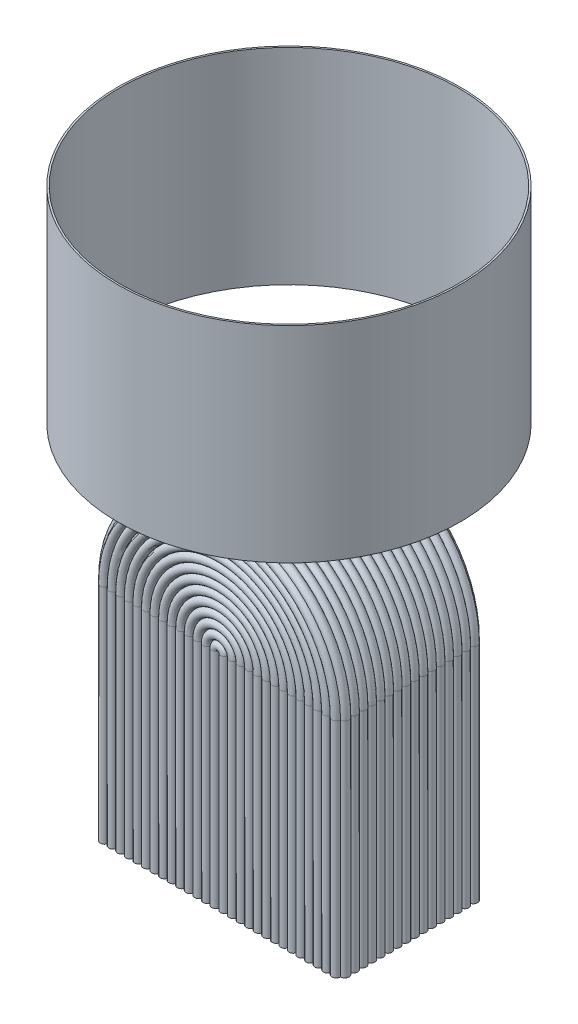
from build123d import *

# Parameters (mm, degrees)
SALIENTE_EXTRUIR1_DEPTH = 160
VACIADO1_T              = -20
BARRER1_PROFILE_R       = 5
BARRER2_PROFILE_R       = 5
BARRER3_PROFILE_R       = 5
BARRER4_PROFILE_R       = 5
BARRER5_PROFILE_R       = 5
BARRER6_PROFILE_R       = 5
BARRER7_PROFILE_R       = 5
BARRER8_PROFILE_R       = 5
BARRER9_PROFILE_R       = 5
BARRER10_PROFILE_R      = 5
BARRER11_PROFILE_R      = 5
BARRER12_PROFILE_R      = 5
BARRER13_PROFILE_R      = 5
BARRER16_PROFILE_R      = 5
BARRER17_PROFILE_R      = 5
MATRIZL1_COUNT          = 16
MATRIZL1_PITCH          = 10
CROQUIS627_R            = 12.5
SALIENTE_EXTRUIR4_DEPTH = 60
CROQUIS91_R             = 200
CROQUIS91_R_2           = 198
SALIENTE_EXTRUIR3_DEPTH = 240
CROQUIS716_R            = 5
CORTAR_EXTRUIR1_DEPTH   = 90
CROQUIS806_W            = 10
CROQUIS806_H            = 2
CROQUIS808_R            = 5
CORTAR_EXTRUIR2_DEPTH   = 180


with BuildPart() as part:
    # Croquis1 → Saliente-Extruir1 (new body)
    with BuildSketch(Plane.XY):
        with BuildLine():
            Line((140.25, 0), (-140.25, 0))
            Line((-140.25, 0), (-140.25, 260))
            ThreePointArc((-140.25, 260), (0, 400.25), (140.25, 260))
            Line((140.25, 260), (140.25, 0))
        make_face()
    extrude(amount=SALIENTE_EXTRUIR1_DEPTH)

    # Vaciado1
    vaciado1_openings = [part.faces().sort_by_distance(p)[0] for p in [
        (0, 0, 80),
    ]]
    offset(amount=VACIADO1_T, openings=vaciado1_openings, kind=Kind.INTERSECTION)

    # Barrer1: sweep along a path in Croquis232
    with BuildLine(Plane.XY.offset(160)) as barrer1_path:
        Line((135.25, 0), (135.25, 260))
        ThreePointArc((135.25, 260), (0, 395.25), (-135.25, 260))
        Line((-135.25, 260), (-135.25, 0))
    # Barrer1 profile (on start of the path) → Barrer1 (sweep)
    with BuildSketch(Plane(origin=(135.25, 0, 160), x_dir=(0, 0, 1), z_dir=(0, 1, 0))):
        Circle(BARRER1_PROFILE_R)
    barrer1 = sweep(path=barrer1_path.line)

    # Barrer2: sweep along a path in Croquis247
    with BuildLine(Plane.XY.offset(160)) as barrer2_path:
        Line((125.25, 0), (125.25, 260))
        ThreePointArc((125.25, 260), (0, 385.25), (-125.25, 260))
        Line((-125.25, 260), (-125.25, 0))
    # Barrer2 profile (on start of the path) → Barrer2 (sweep)
    with BuildSketch(Plane(origin=(125.25, 0, 160), x_dir=(0, 0, 1), z_dir=(0, 1, 0))):
        Circle(BARRER2_PROFILE_R)
    barrer2 = sweep(path=barrer2_path.line)

    # Barrer3: sweep along a path in Croquis256
    with BuildLine(Plane.XY.offset(160)) as barrer3_path:
        Line((-115.25, 0), (-115.25, 260))
        ThreePointArc((-115.25, 260), (0, 375.25), (115.25, 260))
        Line((115.25, 260), (115.25, 0))
    # Barrer3 profile (on start of the path) → Barrer3 (sweep)
    with BuildSketch(Plane(origin=(-115.25, 0, 160), x_dir=(1, 0, 0), z_dir=(0, 1, 0))):
        Circle(BARRER3_PROFILE_R)
    barrer3 = sweep(path=barrer3_path.line)

    # Barrer4: sweep along a path in Croquis265
    with BuildLine(Plane.XY.offset(160)) as barrer4_path:
        Line((105.25, 0), (105.25, 260))
        ThreePointArc((105.25, 260), (0, 365.25), (-105.25, 260))
        Line((-105.25, 260), (-105.25, 0))
    # Barrer4 profile (on start of the path) → Barrer4 (sweep)
    with BuildSketch(Plane(origin=(105.25, 0, 160), x_dir=(1, 0, 0), z_dir=(0, 1, 0))):
        Circle(BARRER4_PROFILE_R)
    barrer4 = sweep(path=barrer4_path.line)

    # Barrer5: sweep along a path in Croquis274
    with BuildLine(Plane.XY.offset(160)) as barrer5_path:
        Line((95.25, 0), (95.25, 260))
        ThreePointArc((95.25, 260), (0, 355.25), (-95.25, 260))
        Line((-95.25, 260), (-95.25, 0))
    # Barrer5 profile (on start of the path) → Barrer5 (sweep)
    with BuildSketch(Plane(origin=(95.25, 0, 160), x_dir=(1, 0, 0), z_dir=(0, 1, 0))):
        Circle(BARRER5_PROFILE_R)
    barrer5 = sweep(path=barrer5_path.line)

    # Barrer6: sweep along a path in Croquis283
    with BuildLine(Plane.XY.offset(160)) as barrer6_path:
        Line((-85.25, 0), (-85.25, 260))
        ThreePointArc((-85.25, 260), (0, 345.25), (85.25, 260))
        Line((85.25, 260), (85.25, 0))
    # Barrer6 profile (on start of the path) → Barrer6 (sweep)
    with BuildSketch(Plane(origin=(-85.25, 0, 160), x_dir=(1, 0, 0), z_dir=(0, 1, 0))):
        Circle(BARRER6_PROFILE_R)
    barrer6 = sweep(path=barrer6_path.line)

    # Barrer7: sweep along a path in Croquis292
    with BuildLine(Plane.XY.offset(160)) as barrer7_path:
        Line((75.25, 0), (75.25, 260))
        ThreePointArc((75.25, 260), (0, 335.25), (-75.25, 260))
        Line((-75.25, 260), (-75.25, 0))
    # Barrer7 profile (on start of the path) → Barrer7 (sweep)
    with BuildSketch(Plane(origin=(75.25, 0, 160), x_dir=(1, 0, 0), z_dir=(0, 1, 0))):
        Circle(BARRER7_PROFILE_R)
    barrer7 = sweep(path=barrer7_path.line)

    # Barrer8: sweep along a path in Croquis301
    with BuildLine(Plane.XY.offset(160)) as barrer8_path:
        Line((65.25, 0), (65.25, 260))
        ThreePointArc((65.25, 260), (0, 325.25), (-65.25, 260))
        Line((-65.25, 260), (-65.25, 0))
    # Barrer8 profile (on start of the path) → Barrer8 (sweep)
    with BuildSketch(Plane(origin=(65.25, 0, 160), x_dir=(1, 0, 0), z_dir=(0, 1, 0))):
        Circle(BARRER8_PROFILE_R)
    barrer8 = sweep(path=barrer8_path.line)

    # Barrer9: sweep along a path in Croquis310
    with BuildLine(Plane.XY.offset(160)) as barrer9_path:
        Line((55.25, 0), (55.25, 260))
        ThreePointArc((55.25, 260), (0, 315.25), (-55.25, 260))
        Line((-55.25, 260), (-55.25, 0))
    # Barrer9 profile (on start of the path) → Barrer9 (sweep)
    with BuildSketch(Plane(origin=(55.25, 0, 160), x_dir=(1, 0, 0), z_dir=(0, 1, 0))):
        Circle(BARRER9_PROFILE_R)
    barrer9 = sweep(path=barrer9_path.line)

    # Barrer10: sweep along a path in Croquis319
    with BuildLine(Plane.XY.offset(160)) as barrer10_path:
        Line((45.25, 0), (45.25, 260))
        ThreePointArc((45.25, 260), (0, 305.25), (-45.25, 260))
        Line((-45.25, 260), (-45.25, 0))
    # Barrer10 profile (on start of the path) → Barrer10 (sweep)
    with BuildSketch(Plane(origin=(45.25, 0, 160), x_dir=(1, 0, 0), z_dir=(0, 1, 0))):
        Circle(BARRER10_PROFILE_R)
    barrer10 = sweep(path=barrer10_path.line)

    # Barrer11: sweep along a path in Croquis328
    with BuildLine(Plane.XY.offset(160)) as barrer11_path:
        Line((35.25, 0), (35.25, 260))
        ThreePointArc((35.25, 260), (0, 295.25), (-35.25, 260))
        Line((-35.25, 260), (-35.25, 0))
    # Barrer11 profile (on start of the path) → Barrer11 (sweep)
    with BuildSketch(Plane(origin=(35.25, 0, 160), x_dir=(1, 0, 0), z_dir=(0, 1, 0))):
        Circle(BARRER11_PROFILE_R)
    barrer11 = sweep(path=barrer11_path.line)

    # Barrer12: sweep along a path in Croquis337
    with BuildLine(Plane.XY.offset(160)) as barrer12_path:
        Line((25.25, 0), (25.25, 260))
        ThreePointArc((25.25, 260), (0, 285.25), (-25.25, 260))
        Line((-25.25, 260), (-25.25, 0))
    # Barrer12 profile (on start of the path) → Barrer12 (sweep)
    with BuildSketch(Plane(origin=(25.25, 0, 160), x_dir=(1, 0, 0), z_dir=(0, 1, 0))):
        Circle(BARRER12_PROFILE_R)
    barrer12 = sweep(path=barrer12_path.line)

    # Barrer13: sweep along a path in Croquis346
    with BuildLine(Plane.XY.offset(160)) as barrer13_path:
        Line((15.25, 0), (15.25, 260))
        ThreePointArc((15.25, 260), (0, 275.25), (-15.25, 260))
        Line((-15.25, 260), (-15.25, 0))
    # Barrer13 profile (on start of the path) → Barrer13 (sweep)
    with BuildSketch(Plane(origin=(15.25, 0, 160), x_dir=(1, 0, 0), z_dir=(0, 1, 0))):
        Circle(BARRER13_PROFILE_R)
    barrer13 = sweep(path=barrer13_path.line)

    # Barrer16: sweep along a path in Croquis355
    with BuildLine(Plane.XY.offset(160)) as barrer16_path:
        Line((-5.25, 0), (-5.25, 260))
        ThreePointArc((-5.25, 260), (0, 265.25), (5.25, 260))
        Line((5.25, 260), (5.25, 0))
    # Barrer16 profile (on start of the path) → Barrer16 (sweep)
    with BuildSketch(Plane(origin=(-5.25, 0, 160), x_dir=(1, 0, 0), z_dir=(0, 1, 0))):
        Circle(BARRER16_PROFILE_R)
    barrer16 = sweep(path=barrer16_path.line)

    # Barrer17: sweep along a path in Croquis542
    with BuildLine(Plane(origin=(0, 0, 5), x_dir=(-1, 0, 0), z_dir=(0, 0, -1))) as barrer17_path:
        Line((140.25, 0), (140.25, 260))
        ThreePointArc((140.25, 260), (0, 400.25), (-140.25, 260))
        Line((-140.25, 260), (-140.25, 0))
    # Barrer17 profile (on start of the path) → Barrer17 (sweep)
    with BuildSketch(Plane(origin=(-140.25, 0, 5), x_dir=(0, 0, 1), z_dir=(0, 1, 0))):
        Circle(BARRER17_PROFILE_R)
    barrer17 = sweep(path=barrer17_path.line)

    # MatrizL1: Barrer17 ×16
    with Locations(*[(0, 0, i * MATRIZL1_PITCH) for i in range(1, MATRIZL1_COUNT)]):
        add(barrer17)

    # Simetr_a1: Barrer1, Barrer2, Barrer3, Barrer4, Barrer5, Barrer6, Barrer7, Barrer8, Barrer9, Barrer10, Barrer11, Barrer12, Barrer13, Barrer16 across plane
    add(barrer1.mirror(Plane(origin=(0, 0, 80), x_dir=(1, 0, 0), z_dir=(0, 0, -1))))
    add(barrer2.mirror(Plane(origin=(0, 0, 80), x_dir=(1, 0, 0), z_dir=(0, 0, -1))))
    add(barrer3.mirror(Plane(origin=(0, 0, 80), x_dir=(1, 0, 0), z_dir=(0, 0, -1))))
    add(barrer4.mirror(Plane(origin=(0, 0, 80), x_dir=(1, 0, 0), z_dir=(0, 0, -1))))
    add(barrer5.mirror(Plane(origin=(0, 0, 80), x_dir=(1, 0, 0), z_dir=(0, 0, -1))))
    add(barrer6.mirror(Plane(origin=(0, 0, 80), x_dir=(1, 0, 0), z_dir=(0, 0, -1))))
    add(barrer7.mirror(Plane(origin=(0, 0, 80), x_dir=(1, 0, 0), z_dir=(0, 0, -1))))
    add(barrer8.mirror(Plane(origin=(0, 0, 80), x_dir=(1, 0, 0), z_dir=(0, 0, -1))))
    add(barrer9.mirror(Plane(origin=(0, 0, 80), x_dir=(1, 0, 0), z_dir=(0, 0, -1))))
    add(barrer10.mirror(Plane(origin=(0, 0, 80), x_dir=(1, 0, 0), z_dir=(0, 0, -1))))
    add(barrer11.mirror(Plane(origin=(0, 0, 80), x_dir=(1, 0, 0), z_dir=(0, 0, -1))))
    add(barrer12.mirror(Plane(origin=(0, 0, 80), x_dir=(1, 0, 0), z_dir=(0, 0, -1))))
    add(barrer13.mirror(Plane(origin=(0, 0, 80), x_dir=(1, 0, 0), z_dir=(0, 0, -1))))
    add(barrer16.mirror(Plane(origin=(0, 0, 80), x_dir=(1, 0, 0), z_dir=(0, 0, -1))))

    # Croquis716 → Cortar-Extruir1 (cut)
    with BuildSketch(Plane(origin=(0, 430, 0), x_dir=(1, 0, 0), z_dir=(0, 1, 0))):
        with Locations(Location((0, -80, 0), (0, 0, 270))):
            Circle(CROQUIS716_R)
    extrude(amount=-CORTAR_EXTRUIR1_DEPTH, mode=Mode.SUBTRACT)


with BuildPart() as body_2:
    # Croquis627 → Saliente-Extruir4 (new body)
    with BuildSketch(Plane(origin=(0, 390, 0), x_dir=(1, 0, 0), z_dir=(0, 1, 0))):
        with Locations(Location((0, -80, 0), (0, 0, 90))):
            Circle(CROQUIS627_R)
    extrude(amount=SALIENTE_EXTRUIR4_DEPTH)


    add(part.part)  # Revoluci_n1 merges part
    # Croquis806 → Revoluci_n1 (revolve)
    with BuildSketch(Plane(origin=(0, 0, 80), x_dir=(-1, 0, 0), z_dir=(0, 0, -1)), mode=Mode.PRIVATE) as revoluci_n1_sk:
        with Locations((-17.505418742, 405.710666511)):
            Rectangle(CROQUIS806_W, CROQUIS806_H)
    revolve(revoluci_n1_sk.sketch.rotate(Axis((0, 0, 80), (0, 1, 0)), 126.86989305), axis=Axis((0, 0, 80), (0, 1, 0)))

    # Croquis807 → Revoluci_n2 (revolve)
    with BuildSketch(Plane(origin=(0, 0, 0), x_dir=(0, 0, -1), z_dir=(1, 0, 0)), mode=Mode.PRIVATE) as revoluci_n2_sk:
        with BuildLine():
            Line((-80, 450), (-91.645258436, 450))
            ThreePointArc((-91.645258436, 450), (-102.771963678, 473.811605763), (-105, 500))
            Line((-105, 500), (-103, 500))
            ThreePointArc((-103, 500), (-100.879877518, 474.945652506), (-90.598229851, 452))
            Line((-90.598229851, 452), (-80, 452))
            Line((-80, 452), (-80, 450))
        make_face()
    revolve(revoluci_n2_sk.sketch.rotate(Axis((0, 450, 80), (0, 1, 0)), 180), axis=Axis((0, 450, 80), (0, 1, 0)))

    # Croquis808 → Cortar-Extruir2 (cut)
    with BuildSketch(Plane(origin=(0, 0, 0), x_dir=(0, 0, -1), z_dir=(1, 0, 0))):
        with Locations((-80, 47.324546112)):
            Circle(CROQUIS808_R)
    extrude(amount=-CORTAR_EXTRUIR2_DEPTH, mode=Mode.SUBTRACT)


with BuildPart() as body_3:
    # Croquis91 → Saliente-Extruir3 (new body)
    with BuildSketch(Plane(origin=(0, 450, 0), x_dir=(1, 0, 0), z_dir=(0, 1, 0))):
        with Locations(Location((0, -80, 0), (0, 0, 270))):
            Circle(CROQUIS91_R)
        with Locations(Location((0, -80, 0), (0, 0, 270))):
            Circle(CROQUIS91_R_2, mode=Mode.SUBTRACT)
    extrude(amount=SALIENTE_EXTRUIR3_DEPTH)


solid = Compound([body_2.part, body_3.part])
